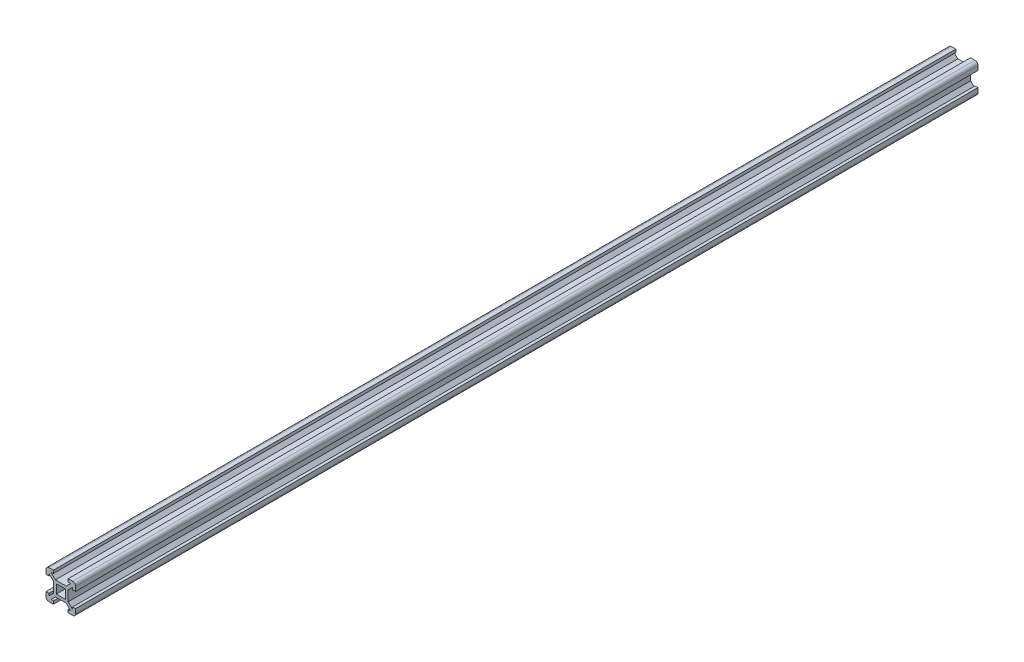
ISO-10303-21;
HEADER;
FILE_DESCRIPTION(('STEP AP214'),'2;1');
FILE_NAME('part.step','',(''),(''),'','','');
FILE_SCHEMA(('AUTOMOTIVE_DESIGN { 1 0 10303 214 1 1 1 1 }'));
ENDSEC;
DATA;
#1=APPLICATION_CONTEXT('core data for automotive mechanical design processes');
#2=APPLICATION_PROTOCOL_DEFINITION('international standard','automotive_design',2000,#1);
#3=PRODUCT_CONTEXT('',#1,'mechanical');
#4=PRODUCT('Part','Part','',(#3));
#5=PRODUCT_RELATED_PRODUCT_CATEGORY('part','',(#4));
#6=PRODUCT_DEFINITION_FORMATION('','',#4);
#7=PRODUCT_DEFINITION_CONTEXT('part definition',#1,'design');
#8=PRODUCT_DEFINITION('design','',#6,#7);
#9=PRODUCT_DEFINITION_SHAPE('','',#8);
#10=(LENGTH_UNIT() NAMED_UNIT(*) SI_UNIT(.MILLI.,.METRE.));
#11=(NAMED_UNIT(*) PLANE_ANGLE_UNIT() SI_UNIT($,.RADIAN.));
#12=(NAMED_UNIT(*) SI_UNIT($,.STERADIAN.) SOLID_ANGLE_UNIT());
#13=UNCERTAINTY_MEASURE_WITH_UNIT(LENGTH_MEASURE(1.E-05),#10,'distance_accuracy_value','');
#14=(GEOMETRIC_REPRESENTATION_CONTEXT(3) GLOBAL_UNCERTAINTY_ASSIGNED_CONTEXT((#13)) GLOBAL_UNIT_ASSIGNED_CONTEXT((#10,
#11,#12)) REPRESENTATION_CONTEXT('',''));
#15=CARTESIAN_POINT('',(0.,0.,0.));
#16=DIRECTION('',(0.,0.,1.));
#17=DIRECTION('',(1.,0.,0.));
#18=AXIS2_PLACEMENT_3D('',#15,#16,#17);
#19=CARTESIAN_POINT('',(2.00000000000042,18.0000000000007,610.));
#20=DIRECTION('',(0.,0.,-1.));
#21=DIRECTION('',(-1.,0.,0.));
#22=AXIS2_PLACEMENT_3D('',#19,#20,#21);
#23=PLANE('',#22);
#24=DIRECTION('',(0.712320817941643,-0.701854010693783,0.));
#25=VECTOR('',#24,1.);
#26=CARTESIAN_POINT('',(5.00000000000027,13.5226684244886,610.));
#27=LINE('',#26,#25);
#28=CARTESIAN_POINT('',(2.00000000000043,16.4785865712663,610.));
#29=VERTEX_POINT('',#28);
#30=CARTESIAN_POINT('',(5.00000000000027,13.5226684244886,610.));
#31=VERTEX_POINT('',#30);
#32=EDGE_CURVE('E348',#29,#31,#27,.T.);
#33=ORIENTED_EDGE('',*,*,#32,.T.);
#34=DIRECTION('',(0.,-1.,0.));
#35=VECTOR('',#34,1.);
#36=CARTESIAN_POINT('',(5.00000000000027,13.5226684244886,610.));
#37=LINE('',#36,#35);
#38=CARTESIAN_POINT('',(5.00000000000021,6.47733157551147,610.));
#39=VERTEX_POINT('',#38);
#40=EDGE_CURVE('E351',#31,#39,#37,.T.);
#41=ORIENTED_EDGE('',*,*,#40,.T.);
#42=DIRECTION('',(-0.712320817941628,-0.701854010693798,0.));
#43=VECTOR('',#42,1.);
#44=CARTESIAN_POINT('',(5.00000000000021,6.47733157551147,610.));
#45=LINE('',#44,#43);
#46=CARTESIAN_POINT('',(2.00000000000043,3.52141342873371,610.));
#47=VERTEX_POINT('',#46);
#48=EDGE_CURVE('E354',#39,#47,#45,.T.);
#49=ORIENTED_EDGE('',*,*,#48,.T.);
#50=DIRECTION('',(0.,1.,0.));
#51=VECTOR('',#50,1.);
#52=CARTESIAN_POINT('',(2.00000000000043,3.52141342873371,610.));
#53=LINE('',#52,#51);
#54=CARTESIAN_POINT('',(2.00000000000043,4.99999999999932,610.));
#55=VERTEX_POINT('',#54);
#56=EDGE_CURVE('E356',#47,#55,#53,.T.);
#57=ORIENTED_EDGE('',*,*,#56,.T.);
#58=DIRECTION('',(-1.,0.,0.));
#59=VECTOR('',#58,1.);
#60=CARTESIAN_POINT('',(4.24509251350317E-13,4.99999999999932,610.));
#61=LINE('',#60,#59);
#62=CARTESIAN_POINT('',(4.24509251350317E-13,4.99999999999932,610.));
#63=VERTEX_POINT('',#62);
#64=EDGE_CURVE('E358',#55,#63,#61,.T.);
#65=ORIENTED_EDGE('',*,*,#64,.T.);
#66=DIRECTION('',(0.,-1.,0.));
#67=VECTOR('',#66,1.);
#68=CARTESIAN_POINT('',(4.24509251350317E-13,4.99999999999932,610.));
#69=LINE('',#68,#67);
#70=CARTESIAN_POINT('',(4.24509251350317E-13,1.99999999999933,610.));
#71=VERTEX_POINT('',#70);
#72=EDGE_CURVE('E360',#63,#71,#69,.T.);
#73=ORIENTED_EDGE('',*,*,#72,.T.);
#74=CARTESIAN_POINT('',(2.00000000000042,1.99999999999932,610.));
#75=DIRECTION('',(0.,0.,1.));
#76=DIRECTION('',(1.,0.,0.));
#77=AXIS2_PLACEMENT_3D('',#74,#75,#76);
#78=CIRCLE('',#77,2.);
#79=CARTESIAN_POINT('',(2.00000000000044,-6.83481049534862E-13,610.));
#80=VERTEX_POINT('',#79);
#81=EDGE_CURVE('E362',#71,#80,#78,.T.);
#82=ORIENTED_EDGE('',*,*,#81,.T.);
#83=DIRECTION('',(1.,0.,0.));
#84=VECTOR('',#83,1.);
#85=CARTESIAN_POINT('',(2.00000000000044,-6.83481049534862E-13,610.));
#86=LINE('',#85,#84);
#87=CARTESIAN_POINT('',(5.,-6.83481049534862E-13,610.));
#88=VERTEX_POINT('',#87);
#89=EDGE_CURVE('E364',#80,#88,#86,.T.);
#90=ORIENTED_EDGE('',*,*,#89,.T.);
#91=DIRECTION('',(0.,1.,0.));
#92=VECTOR('',#91,1.);
#93=CARTESIAN_POINT('',(5.,-6.83481049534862E-13,610.));
#94=LINE('',#93,#92);
#95=CARTESIAN_POINT('',(5.,2.,610.));
#96=VERTEX_POINT('',#95);
#97=EDGE_CURVE('E366',#88,#96,#94,.T.);
#98=ORIENTED_EDGE('',*,*,#97,.T.);
#99=DIRECTION('',(-1.,0.,0.));
#100=VECTOR('',#99,1.);
#101=CARTESIAN_POINT('',(3.30549306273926,1.99999999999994,610.));
#102=LINE('',#101,#100);
#103=CARTESIAN_POINT('',(3.30549306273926,1.99999999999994,610.));
#104=VERTEX_POINT('',#103);
#105=EDGE_CURVE('E368',#96,#104,#102,.T.);
#106=ORIENTED_EDGE('',*,*,#105,.T.);
#107=DIRECTION('',(0.712320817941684,0.701854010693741,0.));
#108=VECTOR('',#107,1.);
#109=CARTESIAN_POINT('',(6.35023231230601,4.99999999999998,610.));
#110=LINE('',#109,#108);
#111=CARTESIAN_POINT('',(6.35023231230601,4.99999999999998,610.));
#112=VERTEX_POINT('',#111);
#113=EDGE_CURVE('E370',#104,#112,#110,.T.);
#114=ORIENTED_EDGE('',*,*,#113,.T.);
#115=DIRECTION('',(1.,0.,0.));
#116=VECTOR('',#115,1.);
#117=CARTESIAN_POINT('',(6.35023231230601,4.99999999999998,610.));
#118=LINE('',#117,#116);
#119=CARTESIAN_POINT('',(13.649767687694,4.99999999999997,610.));
#120=VERTEX_POINT('',#119);
#121=EDGE_CURVE('E372',#112,#120,#118,.T.);
#122=ORIENTED_EDGE('',*,*,#121,.T.);
#123=DIRECTION('',(0.712320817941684,-0.701854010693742,0.));
#124=VECTOR('',#123,1.);
#125=CARTESIAN_POINT('',(13.649767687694,4.99999999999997,610.));
#126=LINE('',#125,#124);
#127=CARTESIAN_POINT('',(16.6945069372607,1.99999999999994,610.));
#128=VERTEX_POINT('',#127);
#129=EDGE_CURVE('E374',#120,#128,#126,.T.);
#130=ORIENTED_EDGE('',*,*,#129,.T.);
#131=DIRECTION('',(-1.,0.,0.));
#132=VECTOR('',#131,1.);
#133=CARTESIAN_POINT('',(16.6945069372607,1.99999999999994,610.));
#134=LINE('',#133,#132);
#135=CARTESIAN_POINT('',(15.,2.,610.));
#136=VERTEX_POINT('',#135);
#137=EDGE_CURVE('E376',#128,#136,#134,.T.);
#138=ORIENTED_EDGE('',*,*,#137,.T.);
#139=DIRECTION('',(0.,-1.,0.));
#140=VECTOR('',#139,1.);
#141=CARTESIAN_POINT('',(15.,-6.83481049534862E-13,610.));
#142=LINE('',#141,#140);
#143=CARTESIAN_POINT('',(15.,-6.83481049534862E-13,610.));
#144=VERTEX_POINT('',#143);
#145=EDGE_CURVE('E378',#136,#144,#142,.T.);
#146=ORIENTED_EDGE('',*,*,#145,.T.);
#147=DIRECTION('',(1.,0.,0.));
#148=VECTOR('',#147,1.);
#149=CARTESIAN_POINT('',(17.9999999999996,-6.85562717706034E-13,610.));
#150=LINE('',#149,#148);
#151=CARTESIAN_POINT('',(17.9999999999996,-6.85562717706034E-13,610.));
#152=VERTEX_POINT('',#151);
#153=EDGE_CURVE('E380',#144,#152,#150,.T.);
#154=ORIENTED_EDGE('',*,*,#153,.T.);
#155=CARTESIAN_POINT('',(17.9999999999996,1.99999999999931,610.));
#156=DIRECTION('',(0.,0.,1.));
#157=DIRECTION('',(1.,0.,0.));
#158=AXIS2_PLACEMENT_3D('',#155,#156,#157);
#159=CIRCLE('',#158,2.);
#160=CARTESIAN_POINT('',(19.9999999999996,1.99999999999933,610.));
#161=VERTEX_POINT('',#160);
#162=EDGE_CURVE('E382',#152,#161,#159,.T.);
#163=ORIENTED_EDGE('',*,*,#162,.T.);
#164=DIRECTION('',(0.,1.,0.));
#165=VECTOR('',#164,1.);
#166=CARTESIAN_POINT('',(19.9999999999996,4.99999999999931,610.));
#167=LINE('',#166,#165);
#168=CARTESIAN_POINT('',(19.9999999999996,4.99999999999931,610.));
#169=VERTEX_POINT('',#168);
#170=EDGE_CURVE('E384',#161,#169,#167,.T.);
#171=ORIENTED_EDGE('',*,*,#170,.T.);
#172=DIRECTION('',(-1.,0.,0.));
#173=VECTOR('',#172,1.);
#174=CARTESIAN_POINT('',(19.9999999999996,4.99999999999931,610.));
#175=LINE('',#174,#173);
#176=CARTESIAN_POINT('',(17.9999999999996,4.99999999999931,610.));
#177=VERTEX_POINT('',#176);
#178=EDGE_CURVE('E386',#169,#177,#175,.T.);
#179=ORIENTED_EDGE('',*,*,#178,.T.);
#180=DIRECTION('',(0.,-1.,0.));
#181=VECTOR('',#180,1.);
#182=CARTESIAN_POINT('',(17.9999999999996,3.52141342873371,610.));
#183=LINE('',#182,#181);
#184=CARTESIAN_POINT('',(17.9999999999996,3.52141342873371,610.));
#185=VERTEX_POINT('',#184);
#186=EDGE_CURVE('E388',#177,#185,#183,.T.);
#187=ORIENTED_EDGE('',*,*,#186,.T.);
#188=DIRECTION('',(-0.712320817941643,0.701854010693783,0.));
#189=VECTOR('',#188,1.);
#190=CARTESIAN_POINT('',(14.9999999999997,6.47733157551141,610.));
#191=LINE('',#190,#189);
#192=CARTESIAN_POINT('',(14.9999999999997,6.47733157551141,610.));
#193=VERTEX_POINT('',#192);
#194=EDGE_CURVE('E390',#185,#193,#191,.T.);
#195=ORIENTED_EDGE('',*,*,#194,.T.);
#196=DIRECTION('',(0.,1.,0.));
#197=VECTOR('',#196,1.);
#198=CARTESIAN_POINT('',(14.9999999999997,13.5226684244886,610.));
#199=LINE('',#198,#197);
#200=CARTESIAN_POINT('',(14.9999999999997,13.5226684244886,610.));
#201=VERTEX_POINT('',#200);
#202=EDGE_CURVE('E392',#193,#201,#199,.T.);
#203=ORIENTED_EDGE('',*,*,#202,.T.);
#204=DIRECTION('',(0.712320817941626,0.7018540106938,0.));
#205=VECTOR('',#204,1.);
#206=CARTESIAN_POINT('',(14.9999999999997,13.5226684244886,610.));
#207=LINE('',#206,#205);
#208=CARTESIAN_POINT('',(17.9999999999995,16.4785865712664,610.));
#209=VERTEX_POINT('',#208);
#210=EDGE_CURVE('E394',#201,#209,#207,.T.);
#211=ORIENTED_EDGE('',*,*,#210,.T.);
#212=DIRECTION('',(0.,-1.,0.));
#213=VECTOR('',#212,1.);
#214=CARTESIAN_POINT('',(17.9999999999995,16.4785865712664,610.));
#215=LINE('',#214,#213);
#216=CARTESIAN_POINT('',(17.9999999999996,15.0000000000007,610.));
#217=VERTEX_POINT('',#216);
#218=EDGE_CURVE('E396',#209,#217,#215,.T.);
#219=ORIENTED_EDGE('',*,*,#218,.T.);
#220=DIRECTION('',(1.,0.,0.));
#221=VECTOR('',#220,1.);
#222=CARTESIAN_POINT('',(19.9999999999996,15.0000000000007,610.));
#223=LINE('',#222,#221);
#224=CARTESIAN_POINT('',(19.9999999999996,15.0000000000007,610.));
#225=VERTEX_POINT('',#224);
#226=EDGE_CURVE('E398',#217,#225,#223,.T.);
#227=ORIENTED_EDGE('',*,*,#226,.T.);
#228=DIRECTION('',(0.,1.,0.));
#229=VECTOR('',#228,1.);
#230=CARTESIAN_POINT('',(19.9999999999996,15.0000000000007,610.));
#231=LINE('',#230,#229);
#232=CARTESIAN_POINT('',(19.9999999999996,18.0000000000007,610.));
#233=VERTEX_POINT('',#232);
#234=EDGE_CURVE('E400',#225,#233,#231,.T.);
#235=ORIENTED_EDGE('',*,*,#234,.T.);
#236=CARTESIAN_POINT('',(17.9999999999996,18.0000000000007,610.));
#237=DIRECTION('',(0.,0.,1.));
#238=DIRECTION('',(1.,0.,0.));
#239=AXIS2_PLACEMENT_3D('',#236,#237,#238);
#240=CIRCLE('',#239,2.);
#241=CARTESIAN_POINT('',(17.9999999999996,20.0000000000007,610.));
#242=VERTEX_POINT('',#241);
#243=EDGE_CURVE('E402',#233,#242,#240,.T.);
#244=ORIENTED_EDGE('',*,*,#243,.T.);
#245=DIRECTION('',(-1.,0.,0.));
#246=VECTOR('',#245,1.);
#247=CARTESIAN_POINT('',(17.9999999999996,20.0000000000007,610.));
#248=LINE('',#247,#246);
#249=CARTESIAN_POINT('',(15.,20.0000000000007,610.));
#250=VERTEX_POINT('',#249);
#251=EDGE_CURVE('E404',#242,#250,#248,.T.);
#252=ORIENTED_EDGE('',*,*,#251,.T.);
#253=DIRECTION('',(0.,-1.,0.));
#254=VECTOR('',#253,1.);
#255=CARTESIAN_POINT('',(15.,20.0000000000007,610.));
#256=LINE('',#255,#254);
#257=CARTESIAN_POINT('',(15.,18.,610.));
#258=VERTEX_POINT('',#257);
#259=EDGE_CURVE('E406',#250,#258,#256,.T.);
#260=ORIENTED_EDGE('',*,*,#259,.T.);
#261=DIRECTION('',(1.,0.,0.));
#262=VECTOR('',#261,1.);
#263=CARTESIAN_POINT('',(16.6945069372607,18.0000000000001,610.));
#264=LINE('',#263,#262);
#265=CARTESIAN_POINT('',(16.6945069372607,18.0000000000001,610.));
#266=VERTEX_POINT('',#265);
#267=EDGE_CURVE('E408',#258,#266,#264,.T.);
#268=ORIENTED_EDGE('',*,*,#267,.T.);
#269=DIRECTION('',(-0.712320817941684,-0.701854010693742,0.));
#270=VECTOR('',#269,1.);
#271=CARTESIAN_POINT('',(13.649767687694,15.,610.));
#272=LINE('',#271,#270);
#273=CARTESIAN_POINT('',(13.649767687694,15.,610.));
#274=VERTEX_POINT('',#273);
#275=EDGE_CURVE('E410',#266,#274,#272,.T.);
#276=ORIENTED_EDGE('',*,*,#275,.T.);
#277=DIRECTION('',(-1.,0.,0.));
#278=VECTOR('',#277,1.);
#279=CARTESIAN_POINT('',(6.35023231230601,15.,610.));
#280=LINE('',#279,#278);
#281=CARTESIAN_POINT('',(6.35023231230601,15.,610.));
#282=VERTEX_POINT('',#281);
#283=EDGE_CURVE('E412',#274,#282,#280,.T.);
#284=ORIENTED_EDGE('',*,*,#283,.T.);
#285=DIRECTION('',(-0.712320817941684,0.701854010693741,0.));
#286=VECTOR('',#285,1.);
#287=CARTESIAN_POINT('',(6.35023231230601,15.,610.));
#288=LINE('',#287,#286);
#289=CARTESIAN_POINT('',(3.30549306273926,18.0000000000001,610.));
#290=VERTEX_POINT('',#289);
#291=EDGE_CURVE('E414',#282,#290,#288,.T.);
#292=ORIENTED_EDGE('',*,*,#291,.T.);
#293=DIRECTION('',(1.,0.,0.));
#294=VECTOR('',#293,1.);
#295=CARTESIAN_POINT('',(3.30549306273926,18.0000000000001,610.));
#296=LINE('',#295,#294);
#297=CARTESIAN_POINT('',(5.,18.,610.));
#298=VERTEX_POINT('',#297);
#299=EDGE_CURVE('E416',#290,#298,#296,.T.);
#300=ORIENTED_EDGE('',*,*,#299,.T.);
#301=DIRECTION('',(0.,1.,0.));
#302=VECTOR('',#301,1.);
#303=CARTESIAN_POINT('',(5.,20.0000000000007,610.));
#304=LINE('',#303,#302);
#305=CARTESIAN_POINT('',(5.,20.0000000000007,610.));
#306=VERTEX_POINT('',#305);
#307=EDGE_CURVE('E418',#298,#306,#304,.T.);
#308=ORIENTED_EDGE('',*,*,#307,.T.);
#309=DIRECTION('',(-1.,0.,0.));
#310=VECTOR('',#309,1.);
#311=CARTESIAN_POINT('',(2.00000000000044,20.0000000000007,610.));
#312=LINE('',#311,#310);
#313=CARTESIAN_POINT('',(2.00000000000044,20.0000000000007,610.));
#314=VERTEX_POINT('',#313);
#315=EDGE_CURVE('E420',#306,#314,#312,.T.);
#316=ORIENTED_EDGE('',*,*,#315,.T.);
#317=CARTESIAN_POINT('',(2.00000000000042,18.0000000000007,610.));
#318=DIRECTION('',(0.,0.,1.));
#319=DIRECTION('',(-1.,0.,0.));
#320=AXIS2_PLACEMENT_3D('',#317,#318,#319);
#321=CIRCLE('',#320,2.);
#322=CARTESIAN_POINT('',(4.25007251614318E-13,18.0000000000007,610.));
#323=VERTEX_POINT('',#322);
#324=EDGE_CURVE('E422',#314,#323,#321,.T.);
#325=ORIENTED_EDGE('',*,*,#324,.T.);
#326=DIRECTION('',(0.,-1.,0.));
#327=VECTOR('',#326,1.);
#328=CARTESIAN_POINT('',(4.24509251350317E-13,15.0000000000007,610.));
#329=LINE('',#328,#327);
#330=CARTESIAN_POINT('',(4.24509251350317E-13,15.0000000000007,610.));
#331=VERTEX_POINT('',#330);
#332=EDGE_CURVE('E424',#323,#331,#329,.T.);
#333=ORIENTED_EDGE('',*,*,#332,.T.);
#334=DIRECTION('',(1.,0.,0.));
#335=VECTOR('',#334,1.);
#336=CARTESIAN_POINT('',(4.24509251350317E-13,15.0000000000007,610.));
#337=LINE('',#336,#335);
#338=CARTESIAN_POINT('',(2.00000000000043,15.0000000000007,610.));
#339=VERTEX_POINT('',#338);
#340=EDGE_CURVE('E426',#331,#339,#337,.T.);
#341=ORIENTED_EDGE('',*,*,#340,.T.);
#342=DIRECTION('',(0.,1.,0.));
#343=VECTOR('',#342,1.);
#344=CARTESIAN_POINT('',(2.00000000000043,16.4785865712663,610.));
#345=LINE('',#344,#343);
#346=EDGE_CURVE('E428',#339,#29,#345,.T.);
#347=ORIENTED_EDGE('',*,*,#346,.T.);
#348=EDGE_LOOP('',(#33,#41,#49,#57,#65,#73,#82,#90,#98,#106,#114,#122,#130,#138,#146,#154,#163,
#171,#179,#187,#195,#203,#211,#219,#227,#235,#244,#252,#260,#268,#276,#284,#292,#300,#308,#316,
#325,#333,#341,#347));
#349=FACE_BOUND('',#348,.T.);
#350=DIRECTION('',(0.,1.,0.));
#351=VECTOR('',#350,1.);
#352=CARTESIAN_POINT('',(13.0427076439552,13.0427076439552,610.));
#353=LINE('',#352,#351);
#354=CARTESIAN_POINT('',(13.0427076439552,6.9572923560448,610.));
#355=VERTEX_POINT('',#354);
#356=CARTESIAN_POINT('',(13.0427076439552,13.0427076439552,610.));
#357=VERTEX_POINT('',#356);
#358=EDGE_CURVE('E312',#355,#357,#353,.T.);
#359=ORIENTED_EDGE('',*,*,#358,.F.);
#360=DIRECTION('',(1.,0.,0.));
#361=VECTOR('',#360,1.);
#362=CARTESIAN_POINT('',(6.95729235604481,6.9572923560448,610.));
#363=LINE('',#362,#361);
#364=CARTESIAN_POINT('',(6.95729235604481,6.9572923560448,610.));
#365=VERTEX_POINT('',#364);
#366=EDGE_CURVE('E334',#365,#355,#363,.T.);
#367=ORIENTED_EDGE('',*,*,#366,.F.);
#368=DIRECTION('',(0.,-1.,0.));
#369=VECTOR('',#368,1.);
#370=CARTESIAN_POINT('',(6.95729235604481,13.0427076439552,610.));
#371=LINE('',#370,#369);
#372=CARTESIAN_POINT('',(6.95729235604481,13.0427076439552,610.));
#373=VERTEX_POINT('',#372);
#374=EDGE_CURVE('E332',#373,#365,#371,.T.);
#375=ORIENTED_EDGE('',*,*,#374,.F.);
#376=DIRECTION('',(-1.,0.,0.));
#377=VECTOR('',#376,1.);
#378=CARTESIAN_POINT('',(6.95729235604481,13.0427076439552,610.));
#379=LINE('',#378,#377);
#380=EDGE_CURVE('E320',#357,#373,#379,.T.);
#381=ORIENTED_EDGE('',*,*,#380,.F.);
#382=EDGE_LOOP('',(#359,#367,#375,#381));
#383=FACE_BOUND('',#382,.T.);
#384=ADVANCED_FACE('F31',(#349,#383),#23,.F.);
#385=CARTESIAN_POINT('',(2.00000000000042,18.0000000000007,0.));
#386=DIRECTION('',(0.,0.,-1.));
#387=DIRECTION('',(-1.,0.,0.));
#388=AXIS2_PLACEMENT_3D('',#385,#386,#387);
#389=PLANE('',#388);
#390=DIRECTION('',(0.712320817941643,-0.701854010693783,0.));
#391=VECTOR('',#390,1.);
#392=CARTESIAN_POINT('',(5.00000000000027,13.5226684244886,0.));
#393=LINE('',#392,#391);
#394=CARTESIAN_POINT('',(2.00000000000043,16.4785865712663,0.));
#395=VERTEX_POINT('',#394);
#396=CARTESIAN_POINT('',(5.00000000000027,13.5226684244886,0.));
#397=VERTEX_POINT('',#396);
#398=EDGE_CURVE('E328',#395,#397,#393,.T.);
#399=ORIENTED_EDGE('',*,*,#398,.F.);
#400=DIRECTION('',(0.,1.,0.));
#401=VECTOR('',#400,1.);
#402=CARTESIAN_POINT('',(2.00000000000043,16.4785865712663,0.));
#403=LINE('',#402,#401);
#404=CARTESIAN_POINT('',(2.00000000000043,15.0000000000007,0.));
#405=VERTEX_POINT('',#404);
#406=EDGE_CURVE('E352',#405,#395,#403,.T.);
#407=ORIENTED_EDGE('',*,*,#406,.F.);
#408=DIRECTION('',(1.,0.,0.));
#409=VECTOR('',#408,1.);
#410=CARTESIAN_POINT('',(4.24509251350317E-13,15.0000000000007,0.));
#411=LINE('',#410,#409);
#412=CARTESIAN_POINT('',(4.24509251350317E-13,15.0000000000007,0.));
#413=VERTEX_POINT('',#412);
#414=EDGE_CURVE('E507',#413,#405,#411,.T.);
#415=ORIENTED_EDGE('',*,*,#414,.F.);
#416=DIRECTION('',(0.,-1.,0.));
#417=VECTOR('',#416,1.);
#418=CARTESIAN_POINT('',(4.24509251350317E-13,15.0000000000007,0.));
#419=LINE('',#418,#417);
#420=CARTESIAN_POINT('',(4.25007251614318E-13,18.0000000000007,0.));
#421=VERTEX_POINT('',#420);
#422=EDGE_CURVE('E505',#421,#413,#419,.T.);
#423=ORIENTED_EDGE('',*,*,#422,.F.);
#424=CARTESIAN_POINT('',(2.00000000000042,18.0000000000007,0.));
#425=DIRECTION('',(0.,0.,1.));
#426=DIRECTION('',(-1.,0.,0.));
#427=AXIS2_PLACEMENT_3D('',#424,#425,#426);
#428=CIRCLE('',#427,2.);
#429=CARTESIAN_POINT('',(2.00000000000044,20.0000000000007,0.));
#430=VERTEX_POINT('',#429);
#431=EDGE_CURVE('E503',#430,#421,#428,.T.);
#432=ORIENTED_EDGE('',*,*,#431,.F.);
#433=DIRECTION('',(-1.,0.,0.));
#434=VECTOR('',#433,1.);
#435=CARTESIAN_POINT('',(2.00000000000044,20.0000000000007,0.));
#436=LINE('',#435,#434);
#437=CARTESIAN_POINT('',(5.,20.0000000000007,0.));
#438=VERTEX_POINT('',#437);
#439=EDGE_CURVE('E501',#438,#430,#436,.T.);
#440=ORIENTED_EDGE('',*,*,#439,.F.);
#441=DIRECTION('',(0.,1.,0.));
#442=VECTOR('',#441,1.);
#443=CARTESIAN_POINT('',(5.,20.0000000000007,0.));
#444=LINE('',#443,#442);
#445=CARTESIAN_POINT('',(5.,18.,0.));
#446=VERTEX_POINT('',#445);
#447=EDGE_CURVE('E499',#446,#438,#444,.T.);
#448=ORIENTED_EDGE('',*,*,#447,.F.);
#449=DIRECTION('',(1.,0.,0.));
#450=VECTOR('',#449,1.);
#451=CARTESIAN_POINT('',(3.30549306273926,18.0000000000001,0.));
#452=LINE('',#451,#450);
#453=CARTESIAN_POINT('',(3.30549306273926,18.0000000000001,0.));
#454=VERTEX_POINT('',#453);
#455=EDGE_CURVE('E497',#454,#446,#452,.T.);
#456=ORIENTED_EDGE('',*,*,#455,.F.);
#457=DIRECTION('',(-0.712320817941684,0.701854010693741,0.));
#458=VECTOR('',#457,1.);
#459=CARTESIAN_POINT('',(6.35023231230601,15.,0.));
#460=LINE('',#459,#458);
#461=CARTESIAN_POINT('',(6.35023231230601,15.,0.));
#462=VERTEX_POINT('',#461);
#463=EDGE_CURVE('E495',#462,#454,#460,.T.);
#464=ORIENTED_EDGE('',*,*,#463,.F.);
#465=DIRECTION('',(-1.,0.,0.));
#466=VECTOR('',#465,1.);
#467=CARTESIAN_POINT('',(6.35023231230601,15.,0.));
#468=LINE('',#467,#466);
#469=CARTESIAN_POINT('',(13.649767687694,15.,0.));
#470=VERTEX_POINT('',#469);
#471=EDGE_CURVE('E493',#470,#462,#468,.T.);
#472=ORIENTED_EDGE('',*,*,#471,.F.);
#473=DIRECTION('',(-0.712320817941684,-0.701854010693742,0.));
#474=VECTOR('',#473,1.);
#475=CARTESIAN_POINT('',(13.649767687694,15.,0.));
#476=LINE('',#475,#474);
#477=CARTESIAN_POINT('',(16.6945069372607,18.0000000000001,0.));
#478=VERTEX_POINT('',#477);
#479=EDGE_CURVE('E491',#478,#470,#476,.T.);
#480=ORIENTED_EDGE('',*,*,#479,.F.);
#481=DIRECTION('',(1.,0.,0.));
#482=VECTOR('',#481,1.);
#483=CARTESIAN_POINT('',(16.6945069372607,18.0000000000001,0.));
#484=LINE('',#483,#482);
#485=CARTESIAN_POINT('',(15.,18.,0.));
#486=VERTEX_POINT('',#485);
#487=EDGE_CURVE('E489',#486,#478,#484,.T.);
#488=ORIENTED_EDGE('',*,*,#487,.F.);
#489=DIRECTION('',(0.,-1.,0.));
#490=VECTOR('',#489,1.);
#491=CARTESIAN_POINT('',(15.,20.0000000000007,0.));
#492=LINE('',#491,#490);
#493=CARTESIAN_POINT('',(15.,20.0000000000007,0.));
#494=VERTEX_POINT('',#493);
#495=EDGE_CURVE('E487',#494,#486,#492,.T.);
#496=ORIENTED_EDGE('',*,*,#495,.F.);
#497=DIRECTION('',(-1.,0.,0.));
#498=VECTOR('',#497,1.);
#499=CARTESIAN_POINT('',(17.9999999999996,20.0000000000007,0.));
#500=LINE('',#499,#498);
#501=CARTESIAN_POINT('',(17.9999999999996,20.0000000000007,0.));
#502=VERTEX_POINT('',#501);
#503=EDGE_CURVE('E485',#502,#494,#500,.T.);
#504=ORIENTED_EDGE('',*,*,#503,.F.);
#505=CARTESIAN_POINT('',(17.9999999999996,18.0000000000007,0.));
#506=DIRECTION('',(0.,0.,1.));
#507=DIRECTION('',(1.,0.,0.));
#508=AXIS2_PLACEMENT_3D('',#505,#506,#507);
#509=CIRCLE('',#508,2.);
#510=CARTESIAN_POINT('',(19.9999999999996,18.0000000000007,0.));
#511=VERTEX_POINT('',#510);
#512=EDGE_CURVE('E483',#511,#502,#509,.T.);
#513=ORIENTED_EDGE('',*,*,#512,.F.);
#514=DIRECTION('',(0.,1.,0.));
#515=VECTOR('',#514,1.);
#516=CARTESIAN_POINT('',(19.9999999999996,15.0000000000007,0.));
#517=LINE('',#516,#515);
#518=CARTESIAN_POINT('',(19.9999999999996,15.0000000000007,0.));
#519=VERTEX_POINT('',#518);
#520=EDGE_CURVE('E481',#519,#511,#517,.T.);
#521=ORIENTED_EDGE('',*,*,#520,.F.);
#522=DIRECTION('',(1.,0.,0.));
#523=VECTOR('',#522,1.);
#524=CARTESIAN_POINT('',(19.9999999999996,15.0000000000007,0.));
#525=LINE('',#524,#523);
#526=CARTESIAN_POINT('',(17.9999999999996,15.0000000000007,0.));
#527=VERTEX_POINT('',#526);
#528=EDGE_CURVE('E479',#527,#519,#525,.T.);
#529=ORIENTED_EDGE('',*,*,#528,.F.);
#530=DIRECTION('',(0.,-1.,0.));
#531=VECTOR('',#530,1.);
#532=CARTESIAN_POINT('',(17.9999999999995,16.4785865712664,0.));
#533=LINE('',#532,#531);
#534=CARTESIAN_POINT('',(17.9999999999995,16.4785865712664,0.));
#535=VERTEX_POINT('',#534);
#536=EDGE_CURVE('E477',#535,#527,#533,.T.);
#537=ORIENTED_EDGE('',*,*,#536,.F.);
#538=DIRECTION('',(0.712320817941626,0.7018540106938,0.));
#539=VECTOR('',#538,1.);
#540=CARTESIAN_POINT('',(14.9999999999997,13.5226684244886,0.));
#541=LINE('',#540,#539);
#542=CARTESIAN_POINT('',(14.9999999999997,13.5226684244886,0.));
#543=VERTEX_POINT('',#542);
#544=EDGE_CURVE('E475',#543,#535,#541,.T.);
#545=ORIENTED_EDGE('',*,*,#544,.F.);
#546=DIRECTION('',(0.,1.,0.));
#547=VECTOR('',#546,1.);
#548=CARTESIAN_POINT('',(14.9999999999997,13.5226684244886,0.));
#549=LINE('',#548,#547);
#550=CARTESIAN_POINT('',(14.9999999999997,6.47733157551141,0.));
#551=VERTEX_POINT('',#550);
#552=EDGE_CURVE('E473',#551,#543,#549,.T.);
#553=ORIENTED_EDGE('',*,*,#552,.F.);
#554=DIRECTION('',(-0.712320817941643,0.701854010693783,0.));
#555=VECTOR('',#554,1.);
#556=CARTESIAN_POINT('',(14.9999999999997,6.47733157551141,0.));
#557=LINE('',#556,#555);
#558=CARTESIAN_POINT('',(17.9999999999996,3.52141342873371,0.));
#559=VERTEX_POINT('',#558);
#560=EDGE_CURVE('E471',#559,#551,#557,.T.);
#561=ORIENTED_EDGE('',*,*,#560,.F.);
#562=DIRECTION('',(0.,-1.,0.));
#563=VECTOR('',#562,1.);
#564=CARTESIAN_POINT('',(17.9999999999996,3.52141342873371,0.));
#565=LINE('',#564,#563);
#566=CARTESIAN_POINT('',(17.9999999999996,4.99999999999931,0.));
#567=VERTEX_POINT('',#566);
#568=EDGE_CURVE('E469',#567,#559,#565,.T.);
#569=ORIENTED_EDGE('',*,*,#568,.F.);
#570=DIRECTION('',(-1.,0.,0.));
#571=VECTOR('',#570,1.);
#572=CARTESIAN_POINT('',(19.9999999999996,4.99999999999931,0.));
#573=LINE('',#572,#571);
#574=CARTESIAN_POINT('',(19.9999999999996,4.99999999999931,0.));
#575=VERTEX_POINT('',#574);
#576=EDGE_CURVE('E467',#575,#567,#573,.T.);
#577=ORIENTED_EDGE('',*,*,#576,.F.);
#578=DIRECTION('',(0.,1.,0.));
#579=VECTOR('',#578,1.);
#580=CARTESIAN_POINT('',(19.9999999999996,4.99999999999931,0.));
#581=LINE('',#580,#579);
#582=CARTESIAN_POINT('',(19.9999999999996,1.99999999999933,0.));
#583=VERTEX_POINT('',#582);
#584=EDGE_CURVE('E465',#583,#575,#581,.T.);
#585=ORIENTED_EDGE('',*,*,#584,.F.);
#586=CARTESIAN_POINT('',(17.9999999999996,1.99999999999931,0.));
#587=DIRECTION('',(0.,0.,1.));
#588=DIRECTION('',(1.,0.,0.));
#589=AXIS2_PLACEMENT_3D('',#586,#587,#588);
#590=CIRCLE('',#589,2.);
#591=CARTESIAN_POINT('',(17.9999999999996,-6.85562717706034E-13,0.));
#592=VERTEX_POINT('',#591);
#593=EDGE_CURVE('E463',#592,#583,#590,.T.);
#594=ORIENTED_EDGE('',*,*,#593,.F.);
#595=DIRECTION('',(1.,0.,0.));
#596=VECTOR('',#595,1.);
#597=CARTESIAN_POINT('',(17.9999999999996,-6.85562717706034E-13,0.));
#598=LINE('',#597,#596);
#599=CARTESIAN_POINT('',(15.,-6.83481049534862E-13,0.));
#600=VERTEX_POINT('',#599);
#601=EDGE_CURVE('E461',#600,#592,#598,.T.);
#602=ORIENTED_EDGE('',*,*,#601,.F.);
#603=DIRECTION('',(0.,-1.,0.));
#604=VECTOR('',#603,1.);
#605=CARTESIAN_POINT('',(15.,-6.83481049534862E-13,0.));
#606=LINE('',#605,#604);
#607=CARTESIAN_POINT('',(15.,2.,0.));
#608=VERTEX_POINT('',#607);
#609=EDGE_CURVE('E459',#608,#600,#606,.T.);
#610=ORIENTED_EDGE('',*,*,#609,.F.);
#611=DIRECTION('',(-1.,0.,0.));
#612=VECTOR('',#611,1.);
#613=CARTESIAN_POINT('',(16.6945069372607,1.99999999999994,0.));
#614=LINE('',#613,#612);
#615=CARTESIAN_POINT('',(16.6945069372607,1.99999999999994,0.));
#616=VERTEX_POINT('',#615);
#617=EDGE_CURVE('E457',#616,#608,#614,.T.);
#618=ORIENTED_EDGE('',*,*,#617,.F.);
#619=DIRECTION('',(0.712320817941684,-0.701854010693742,0.));
#620=VECTOR('',#619,1.);
#621=CARTESIAN_POINT('',(13.649767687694,4.99999999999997,0.));
#622=LINE('',#621,#620);
#623=CARTESIAN_POINT('',(13.649767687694,4.99999999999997,0.));
#624=VERTEX_POINT('',#623);
#625=EDGE_CURVE('E455',#624,#616,#622,.T.);
#626=ORIENTED_EDGE('',*,*,#625,.F.);
#627=DIRECTION('',(1.,0.,0.));
#628=VECTOR('',#627,1.);
#629=CARTESIAN_POINT('',(6.35023231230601,4.99999999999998,0.));
#630=LINE('',#629,#628);
#631=CARTESIAN_POINT('',(6.35023231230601,4.99999999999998,0.));
#632=VERTEX_POINT('',#631);
#633=EDGE_CURVE('E453',#632,#624,#630,.T.);
#634=ORIENTED_EDGE('',*,*,#633,.F.);
#635=DIRECTION('',(0.712320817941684,0.701854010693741,0.));
#636=VECTOR('',#635,1.);
#637=CARTESIAN_POINT('',(6.35023231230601,4.99999999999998,0.));
#638=LINE('',#637,#636);
#639=CARTESIAN_POINT('',(3.30549306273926,1.99999999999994,0.));
#640=VERTEX_POINT('',#639);
#641=EDGE_CURVE('E451',#640,#632,#638,.T.);
#642=ORIENTED_EDGE('',*,*,#641,.F.);
#643=DIRECTION('',(-1.,0.,0.));
#644=VECTOR('',#643,1.);
#645=CARTESIAN_POINT('',(3.30549306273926,1.99999999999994,0.));
#646=LINE('',#645,#644);
#647=CARTESIAN_POINT('',(5.,2.,0.));
#648=VERTEX_POINT('',#647);
#649=EDGE_CURVE('E449',#648,#640,#646,.T.);
#650=ORIENTED_EDGE('',*,*,#649,.F.);
#651=DIRECTION('',(0.,1.,0.));
#652=VECTOR('',#651,1.);
#653=CARTESIAN_POINT('',(5.,-6.83481049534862E-13,0.));
#654=LINE('',#653,#652);
#655=CARTESIAN_POINT('',(5.,-6.83481049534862E-13,0.));
#656=VERTEX_POINT('',#655);
#657=EDGE_CURVE('E447',#656,#648,#654,.T.);
#658=ORIENTED_EDGE('',*,*,#657,.F.);
#659=DIRECTION('',(1.,0.,0.));
#660=VECTOR('',#659,1.);
#661=CARTESIAN_POINT('',(2.00000000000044,-6.83481049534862E-13,0.));
#662=LINE('',#661,#660);
#663=CARTESIAN_POINT('',(2.00000000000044,-6.83481049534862E-13,0.));
#664=VERTEX_POINT('',#663);
#665=EDGE_CURVE('E445',#664,#656,#662,.T.);
#666=ORIENTED_EDGE('',*,*,#665,.F.);
#667=CARTESIAN_POINT('',(2.00000000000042,1.99999999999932,0.));
#668=DIRECTION('',(0.,0.,1.));
#669=DIRECTION('',(1.,0.,0.));
#670=AXIS2_PLACEMENT_3D('',#667,#668,#669);
#671=CIRCLE('',#670,2.);
#672=CARTESIAN_POINT('',(4.24509251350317E-13,1.99999999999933,0.));
#673=VERTEX_POINT('',#672);
#674=EDGE_CURVE('E443',#673,#664,#671,.T.);
#675=ORIENTED_EDGE('',*,*,#674,.F.);
#676=DIRECTION('',(0.,-1.,0.));
#677=VECTOR('',#676,1.);
#678=CARTESIAN_POINT('',(4.24509251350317E-13,4.99999999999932,0.));
#679=LINE('',#678,#677);
#680=CARTESIAN_POINT('',(4.24509251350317E-13,4.99999999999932,0.));
#681=VERTEX_POINT('',#680);
#682=EDGE_CURVE('E441',#681,#673,#679,.T.);
#683=ORIENTED_EDGE('',*,*,#682,.F.);
#684=DIRECTION('',(-1.,0.,0.));
#685=VECTOR('',#684,1.);
#686=CARTESIAN_POINT('',(4.24509251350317E-13,4.99999999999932,0.));
#687=LINE('',#686,#685);
#688=CARTESIAN_POINT('',(2.00000000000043,4.99999999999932,0.));
#689=VERTEX_POINT('',#688);
#690=EDGE_CURVE('E439',#689,#681,#687,.T.);
#691=ORIENTED_EDGE('',*,*,#690,.F.);
#692=DIRECTION('',(0.,1.,0.));
#693=VECTOR('',#692,1.);
#694=CARTESIAN_POINT('',(2.00000000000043,3.52141342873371,0.));
#695=LINE('',#694,#693);
#696=CARTESIAN_POINT('',(2.00000000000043,3.52141342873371,0.));
#697=VERTEX_POINT('',#696);
#698=EDGE_CURVE('E437',#697,#689,#695,.T.);
#699=ORIENTED_EDGE('',*,*,#698,.F.);
#700=DIRECTION('',(-0.712320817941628,-0.701854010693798,0.));
#701=VECTOR('',#700,1.);
#702=CARTESIAN_POINT('',(5.00000000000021,6.47733157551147,0.));
#703=LINE('',#702,#701);
#704=CARTESIAN_POINT('',(5.00000000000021,6.47733157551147,0.));
#705=VERTEX_POINT('',#704);
#706=EDGE_CURVE('E435',#705,#697,#703,.T.);
#707=ORIENTED_EDGE('',*,*,#706,.F.);
#708=DIRECTION('',(0.,-1.,0.));
#709=VECTOR('',#708,1.);
#710=CARTESIAN_POINT('',(5.00000000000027,13.5226684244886,0.));
#711=LINE('',#710,#709);
#712=EDGE_CURVE('E433',#397,#705,#711,.T.);
#713=ORIENTED_EDGE('',*,*,#712,.F.);
#714=EDGE_LOOP('',(#399,#407,#415,#423,#432,#440,#448,#456,#464,#472,#480,#488,#496,#504,#513,
#521,#529,#537,#545,#553,#561,#569,#577,#585,#594,#602,#610,#618,#626,#634,#642,#650,#658,#666,
#675,#683,#691,#699,#707,#713));
#715=FACE_BOUND('',#714,.T.);
#716=DIRECTION('',(1.,0.,0.));
#717=VECTOR('',#716,1.);
#718=CARTESIAN_POINT('',(6.95729235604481,6.9572923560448,0.));
#719=LINE('',#718,#717);
#720=CARTESIAN_POINT('',(6.95729235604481,6.9572923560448,0.));
#721=VERTEX_POINT('',#720);
#722=CARTESIAN_POINT('',(13.0427076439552,6.9572923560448,0.));
#723=VERTEX_POINT('',#722);
#724=EDGE_CURVE('E321',#721,#723,#719,.T.);
#725=ORIENTED_EDGE('',*,*,#724,.T.);
#726=DIRECTION('',(0.,1.,0.));
#727=VECTOR('',#726,1.);
#728=CARTESIAN_POINT('',(13.0427076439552,13.0427076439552,0.));
#729=LINE('',#728,#727);
#730=CARTESIAN_POINT('',(13.0427076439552,13.0427076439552,0.));
#731=VERTEX_POINT('',#730);
#732=EDGE_CURVE('E54',#723,#731,#729,.T.);
#733=ORIENTED_EDGE('',*,*,#732,.T.);
#734=DIRECTION('',(-1.,0.,0.));
#735=VECTOR('',#734,1.);
#736=CARTESIAN_POINT('',(6.95729235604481,13.0427076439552,0.));
#737=LINE('',#736,#735);
#738=CARTESIAN_POINT('',(6.95729235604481,13.0427076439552,0.));
#739=VERTEX_POINT('',#738);
#740=EDGE_CURVE('E327',#731,#739,#737,.T.);
#741=ORIENTED_EDGE('',*,*,#740,.T.);
#742=DIRECTION('',(0.,-1.,0.));
#743=VECTOR('',#742,1.);
#744=CARTESIAN_POINT('',(6.95729235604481,13.0427076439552,0.));
#745=LINE('',#744,#743);
#746=EDGE_CURVE('E340',#739,#721,#745,.T.);
#747=ORIENTED_EDGE('',*,*,#746,.T.);
#748=EDGE_LOOP('',(#725,#733,#741,#747));
#749=FACE_BOUND('',#748,.T.);
#750=ADVANCED_FACE('F633',(#715,#749),#389,.T.);
#751=CARTESIAN_POINT('',(5.00000000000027,13.5226684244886,610.));
#752=DIRECTION('',(0.701854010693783,0.712320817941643,0.));
#753=DIRECTION('',(-0.712320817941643,0.701854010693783,0.));
#754=AXIS2_PLACEMENT_3D('',#751,#752,#753);
#755=PLANE('',#754);
#756=ORIENTED_EDGE('',*,*,#398,.T.);
#757=DIRECTION('',(0.,0.,-1.));
#758=VECTOR('',#757,1.);
#759=CARTESIAN_POINT('',(5.00000000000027,13.5226684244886,610.));
#760=LINE('',#759,#758);
#761=EDGE_CURVE('E11',#31,#397,#760,.T.);
#762=ORIENTED_EDGE('',*,*,#761,.F.);
#763=ORIENTED_EDGE('',*,*,#32,.F.);
#764=DIRECTION('',(0.,0.,-1.));
#765=VECTOR('',#764,1.);
#766=CARTESIAN_POINT('',(2.00000000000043,16.4785865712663,610.));
#767=LINE('',#766,#765);
#768=EDGE_CURVE('E430',#29,#395,#767,.T.);
#769=ORIENTED_EDGE('',*,*,#768,.T.);
#770=EDGE_LOOP('',(#756,#762,#763,#769));
#771=FACE_BOUND('',#770,.T.);
#772=ADVANCED_FACE('F33',(#771),#755,.F.);
#773=CARTESIAN_POINT('',(5.00000000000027,13.5226684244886,610.));
#774=DIRECTION('',(1.,0.,0.));
#775=DIRECTION('',(0.,1.,0.));
#776=AXIS2_PLACEMENT_3D('',#773,#774,#775);
#777=PLANE('',#776);
#778=ORIENTED_EDGE('',*,*,#712,.T.);
#779=DIRECTION('',(0.,0.,-1.));
#780=VECTOR('',#779,1.);
#781=CARTESIAN_POINT('',(5.00000000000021,6.47733157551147,610.));
#782=LINE('',#781,#780);
#783=EDGE_CURVE('E39',#39,#705,#782,.T.);
#784=ORIENTED_EDGE('',*,*,#783,.F.);
#785=ORIENTED_EDGE('',*,*,#40,.F.);
#786=ORIENTED_EDGE('',*,*,#761,.T.);
#787=EDGE_LOOP('',(#778,#784,#785,#786));
#788=FACE_BOUND('',#787,.T.);
#789=ADVANCED_FACE('F650',(#788),#777,.F.);
#790=CARTESIAN_POINT('',(5.00000000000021,6.47733157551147,610.));
#791=DIRECTION('',(0.701854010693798,-0.712320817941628,0.));
#792=DIRECTION('',(0.712320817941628,0.701854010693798,0.));
#793=AXIS2_PLACEMENT_3D('',#790,#791,#792);
#794=PLANE('',#793);
#795=ORIENTED_EDGE('',*,*,#706,.T.);
#796=DIRECTION('',(0.,0.,-1.));
#797=VECTOR('',#796,1.);
#798=CARTESIAN_POINT('',(2.00000000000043,3.52141342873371,610.));
#799=LINE('',#798,#797);
#800=EDGE_CURVE('E620',#47,#697,#799,.T.);
#801=ORIENTED_EDGE('',*,*,#800,.F.);
#802=ORIENTED_EDGE('',*,*,#48,.F.);
#803=ORIENTED_EDGE('',*,*,#783,.T.);
#804=EDGE_LOOP('',(#795,#801,#802,#803));
#805=FACE_BOUND('',#804,.T.);
#806=ADVANCED_FACE('F627',(#805),#794,.F.);
#807=CARTESIAN_POINT('',(2.00000000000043,3.52141342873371,610.));
#808=DIRECTION('',(-1.,0.,0.));
#809=DIRECTION('',(0.,0.,1.));
#810=AXIS2_PLACEMENT_3D('',#807,#808,#809);
#811=PLANE('',#810);
#812=ORIENTED_EDGE('',*,*,#698,.T.);
#813=DIRECTION('',(0.,0.,-1.));
#814=VECTOR('',#813,1.);
#815=CARTESIAN_POINT('',(2.00000000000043,4.99999999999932,610.));
#816=LINE('',#815,#814);
#817=EDGE_CURVE('E617',#55,#689,#816,.T.);
#818=ORIENTED_EDGE('',*,*,#817,.F.);
#819=ORIENTED_EDGE('',*,*,#56,.F.);
#820=ORIENTED_EDGE('',*,*,#800,.T.);
#821=EDGE_LOOP('',(#812,#818,#819,#820));
#822=FACE_BOUND('',#821,.T.);
#823=ADVANCED_FACE('F639',(#822),#811,.F.);
#824=CARTESIAN_POINT('',(4.24509251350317E-13,4.99999999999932,610.));
#825=DIRECTION('',(0.,-1.,0.));
#826=DIRECTION('',(0.,0.,-1.));
#827=AXIS2_PLACEMENT_3D('',#824,#825,#826);
#828=PLANE('',#827);
#829=ORIENTED_EDGE('',*,*,#690,.T.);
#830=DIRECTION('',(0.,0.,-1.));
#831=VECTOR('',#830,1.);
#832=CARTESIAN_POINT('',(4.24509251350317E-13,4.99999999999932,610.));
#833=LINE('',#832,#831);
#834=EDGE_CURVE('E614',#63,#681,#833,.T.);
#835=ORIENTED_EDGE('',*,*,#834,.F.);
#836=ORIENTED_EDGE('',*,*,#64,.F.);
#837=ORIENTED_EDGE('',*,*,#817,.T.);
#838=EDGE_LOOP('',(#829,#835,#836,#837));
#839=FACE_BOUND('',#838,.T.);
#840=ADVANCED_FACE('F643',(#839),#828,.F.);
#841=CARTESIAN_POINT('',(4.24509251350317E-13,4.99999999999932,610.));
#842=DIRECTION('',(1.,0.,0.));
#843=DIRECTION('',(0.,0.,-1.));
#844=AXIS2_PLACEMENT_3D('',#841,#842,#843);
#845=PLANE('',#844);
#846=ORIENTED_EDGE('',*,*,#682,.T.);
#847=DIRECTION('',(0.,0.,-1.));
#848=VECTOR('',#847,1.);
#849=CARTESIAN_POINT('',(4.24509251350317E-13,1.99999999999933,610.));
#850=LINE('',#849,#848);
#851=EDGE_CURVE('E611',#71,#673,#850,.T.);
#852=ORIENTED_EDGE('',*,*,#851,.F.);
#853=ORIENTED_EDGE('',*,*,#72,.F.);
#854=ORIENTED_EDGE('',*,*,#834,.T.);
#855=EDGE_LOOP('',(#846,#852,#853,#854));
#856=FACE_BOUND('',#855,.T.);
#857=ADVANCED_FACE('F823',(#856),#845,.F.);
#858=CARTESIAN_POINT('',(2.00000000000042,1.99999999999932,610.));
#859=DIRECTION('',(0.,0.,-1.));
#860=DIRECTION('',(-1.,0.,0.));
#861=AXIS2_PLACEMENT_3D('',#858,#859,#860);
#862=CYLINDRICAL_SURFACE('',#861,2.);
#863=ORIENTED_EDGE('',*,*,#674,.T.);
#864=DIRECTION('',(0.,0.,-1.));
#865=VECTOR('',#864,1.);
#866=CARTESIAN_POINT('',(2.00000000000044,-6.83481049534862E-13,610.));
#867=LINE('',#866,#865);
#868=EDGE_CURVE('E608',#80,#664,#867,.T.);
#869=ORIENTED_EDGE('',*,*,#868,.F.);
#870=ORIENTED_EDGE('',*,*,#81,.F.);
#871=ORIENTED_EDGE('',*,*,#851,.T.);
#872=EDGE_LOOP('',(#863,#869,#870,#871));
#873=FACE_BOUND('',#872,.T.);
#874=ADVANCED_FACE('F820',(#873),#862,.T.);
#875=CARTESIAN_POINT('',(2.00000000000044,-6.83481049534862E-13,610.));
#876=DIRECTION('',(0.,1.,0.));
#877=DIRECTION('',(0.,0.,1.));
#878=AXIS2_PLACEMENT_3D('',#875,#876,#877);
#879=PLANE('',#878);
#880=ORIENTED_EDGE('',*,*,#665,.T.);
#881=DIRECTION('',(0.,0.,-1.));
#882=VECTOR('',#881,1.);
#883=CARTESIAN_POINT('',(5.,-6.83481049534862E-13,610.));
#884=LINE('',#883,#882);
#885=EDGE_CURVE('E605',#88,#656,#884,.T.);
#886=ORIENTED_EDGE('',*,*,#885,.F.);
#887=ORIENTED_EDGE('',*,*,#89,.F.);
#888=ORIENTED_EDGE('',*,*,#868,.T.);
#889=EDGE_LOOP('',(#880,#886,#887,#888));
#890=FACE_BOUND('',#889,.T.);
#891=ADVANCED_FACE('F816',(#890),#879,.F.);
#892=CARTESIAN_POINT('',(5.,-6.83481049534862E-13,610.));
#893=DIRECTION('',(-1.,0.,0.));
#894=DIRECTION('',(0.,0.,1.));
#895=AXIS2_PLACEMENT_3D('',#892,#893,#894);
#896=PLANE('',#895);
#897=ORIENTED_EDGE('',*,*,#657,.T.);
#898=DIRECTION('',(0.,0.,-1.));
#899=VECTOR('',#898,1.);
#900=CARTESIAN_POINT('',(5.,2.,610.));
#901=LINE('',#900,#899);
#902=EDGE_CURVE('E602',#96,#648,#901,.T.);
#903=ORIENTED_EDGE('',*,*,#902,.F.);
#904=ORIENTED_EDGE('',*,*,#97,.F.);
#905=ORIENTED_EDGE('',*,*,#885,.T.);
#906=EDGE_LOOP('',(#897,#903,#904,#905));
#907=FACE_BOUND('',#906,.T.);
#908=ADVANCED_FACE('F812',(#907),#896,.F.);
#909=CARTESIAN_POINT('',(3.30549306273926,1.99999999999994,610.));
#910=DIRECTION('',(0.,-1.,0.));
#911=DIRECTION('',(1.,0.,0.));
#912=AXIS2_PLACEMENT_3D('',#909,#910,#911);
#913=PLANE('',#912);
#914=ORIENTED_EDGE('',*,*,#649,.T.);
#915=DIRECTION('',(0.,0.,-1.));
#916=VECTOR('',#915,1.);
#917=CARTESIAN_POINT('',(3.30549306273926,1.99999999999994,610.));
#918=LINE('',#917,#916);
#919=EDGE_CURVE('E599',#104,#640,#918,.T.);
#920=ORIENTED_EDGE('',*,*,#919,.F.);
#921=ORIENTED_EDGE('',*,*,#105,.F.);
#922=ORIENTED_EDGE('',*,*,#902,.T.);
#923=EDGE_LOOP('',(#914,#920,#921,#922));
#924=FACE_BOUND('',#923,.T.);
#925=ADVANCED_FACE('F807',(#924),#913,.F.);
#926=CARTESIAN_POINT('',(6.35023231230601,4.99999999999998,610.));
#927=DIRECTION('',(-0.701854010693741,0.712320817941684,0.));
#928=DIRECTION('',(-0.712320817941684,-0.701854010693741,0.));
#929=AXIS2_PLACEMENT_3D('',#926,#927,#928);
#930=PLANE('',#929);
#931=ORIENTED_EDGE('',*,*,#641,.T.);
#932=DIRECTION('',(0.,0.,-1.));
#933=VECTOR('',#932,1.);
#934=CARTESIAN_POINT('',(6.35023231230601,4.99999999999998,610.));
#935=LINE('',#934,#933);
#936=EDGE_CURVE('E596',#112,#632,#935,.T.);
#937=ORIENTED_EDGE('',*,*,#936,.F.);
#938=ORIENTED_EDGE('',*,*,#113,.F.);
#939=ORIENTED_EDGE('',*,*,#919,.T.);
#940=EDGE_LOOP('',(#931,#937,#938,#939));
#941=FACE_BOUND('',#940,.T.);
#942=ADVANCED_FACE('F801',(#941),#930,.F.);
#943=CARTESIAN_POINT('',(6.35023231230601,4.99999999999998,610.));
#944=DIRECTION('',(0.,1.,0.));
#945=DIRECTION('',(-1.,0.,0.));
#946=AXIS2_PLACEMENT_3D('',#943,#944,#945);
#947=PLANE('',#946);
#948=ORIENTED_EDGE('',*,*,#633,.T.);
#949=DIRECTION('',(0.,0.,-1.));
#950=VECTOR('',#949,1.);
#951=CARTESIAN_POINT('',(13.649767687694,4.99999999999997,610.));
#952=LINE('',#951,#950);
#953=EDGE_CURVE('E593',#120,#624,#952,.T.);
#954=ORIENTED_EDGE('',*,*,#953,.F.);
#955=ORIENTED_EDGE('',*,*,#121,.F.);
#956=ORIENTED_EDGE('',*,*,#936,.T.);
#957=EDGE_LOOP('',(#948,#954,#955,#956));
#958=FACE_BOUND('',#957,.T.);
#959=ADVANCED_FACE('F797',(#958),#947,.F.);
#960=CARTESIAN_POINT('',(13.649767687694,4.99999999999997,610.));
#961=DIRECTION('',(0.701854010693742,0.712320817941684,0.));
#962=DIRECTION('',(-0.712320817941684,0.701854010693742,0.));
#963=AXIS2_PLACEMENT_3D('',#960,#961,#962);
#964=PLANE('',#963);
#965=ORIENTED_EDGE('',*,*,#625,.T.);
#966=DIRECTION('',(0.,0.,-1.));
#967=VECTOR('',#966,1.);
#968=CARTESIAN_POINT('',(16.6945069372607,1.99999999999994,610.));
#969=LINE('',#968,#967);
#970=EDGE_CURVE('E590',#128,#616,#969,.T.);
#971=ORIENTED_EDGE('',*,*,#970,.F.);
#972=ORIENTED_EDGE('',*,*,#129,.F.);
#973=ORIENTED_EDGE('',*,*,#953,.T.);
#974=EDGE_LOOP('',(#965,#971,#972,#973));
#975=FACE_BOUND('',#974,.T.);
#976=ADVANCED_FACE('F792',(#975),#964,.F.);
#977=CARTESIAN_POINT('',(16.6945069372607,1.99999999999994,610.));
#978=DIRECTION('',(0.,-1.,0.));
#979=DIRECTION('',(1.,0.,0.));
#980=AXIS2_PLACEMENT_3D('',#977,#978,#979);
#981=PLANE('',#980);
#982=ORIENTED_EDGE('',*,*,#617,.T.);
#983=DIRECTION('',(0.,0.,-1.));
#984=VECTOR('',#983,1.);
#985=CARTESIAN_POINT('',(15.,2.,610.));
#986=LINE('',#985,#984);
#987=EDGE_CURVE('E587',#136,#608,#986,.T.);
#988=ORIENTED_EDGE('',*,*,#987,.F.);
#989=ORIENTED_EDGE('',*,*,#137,.F.);
#990=ORIENTED_EDGE('',*,*,#970,.T.);
#991=EDGE_LOOP('',(#982,#988,#989,#990));
#992=FACE_BOUND('',#991,.T.);
#993=ADVANCED_FACE('F786',(#992),#981,.F.);
#994=CARTESIAN_POINT('',(15.,-6.83481049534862E-13,610.));
#995=DIRECTION('',(1.,0.,0.));
#996=DIRECTION('',(0.,1.,0.));
#997=AXIS2_PLACEMENT_3D('',#994,#995,#996);
#998=PLANE('',#997);
#999=ORIENTED_EDGE('',*,*,#609,.T.);
#1000=DIRECTION('',(0.,0.,-1.));
#1001=VECTOR('',#1000,1.);
#1002=CARTESIAN_POINT('',(15.,-6.83481049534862E-13,610.));
#1003=LINE('',#1002,#1001);
#1004=EDGE_CURVE('E584',#144,#600,#1003,.T.);
#1005=ORIENTED_EDGE('',*,*,#1004,.F.);
#1006=ORIENTED_EDGE('',*,*,#145,.F.);
#1007=ORIENTED_EDGE('',*,*,#987,.T.);
#1008=EDGE_LOOP('',(#999,#1005,#1006,#1007));
#1009=FACE_BOUND('',#1008,.T.);
#1010=ADVANCED_FACE('F782',(#1009),#998,.F.);
#1011=CARTESIAN_POINT('',(17.9999999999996,-6.85562717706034E-13,610.));
#1012=DIRECTION('',(0.,1.,0.));
#1013=DIRECTION('',(-1.,0.,0.));
#1014=AXIS2_PLACEMENT_3D('',#1011,#1012,#1013);
#1015=PLANE('',#1014);
#1016=ORIENTED_EDGE('',*,*,#601,.T.);
#1017=DIRECTION('',(0.,0.,-1.));
#1018=VECTOR('',#1017,1.);
#1019=CARTESIAN_POINT('',(17.9999999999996,-6.85562717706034E-13,610.));
#1020=LINE('',#1019,#1018);
#1021=EDGE_CURVE('E581',#152,#592,#1020,.T.);
#1022=ORIENTED_EDGE('',*,*,#1021,.F.);
#1023=ORIENTED_EDGE('',*,*,#153,.F.);
#1024=ORIENTED_EDGE('',*,*,#1004,.T.);
#1025=EDGE_LOOP('',(#1016,#1022,#1023,#1024));
#1026=FACE_BOUND('',#1025,.T.);
#1027=ADVANCED_FACE('F777',(#1026),#1015,.F.);
#1028=CARTESIAN_POINT('',(17.9999999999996,1.99999999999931,610.));
#1029=DIRECTION('',(0.,0.,-1.));
#1030=DIRECTION('',(-1.,0.,0.));
#1031=AXIS2_PLACEMENT_3D('',#1028,#1029,#1030);
#1032=CYLINDRICAL_SURFACE('',#1031,2.);
#1033=ORIENTED_EDGE('',*,*,#593,.T.);
#1034=DIRECTION('',(0.,0.,-1.));
#1035=VECTOR('',#1034,1.);
#1036=CARTESIAN_POINT('',(19.9999999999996,1.99999999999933,610.));
#1037=LINE('',#1036,#1035);
#1038=EDGE_CURVE('E578',#161,#583,#1037,.T.);
#1039=ORIENTED_EDGE('',*,*,#1038,.F.);
#1040=ORIENTED_EDGE('',*,*,#162,.F.);
#1041=ORIENTED_EDGE('',*,*,#1021,.T.);
#1042=EDGE_LOOP('',(#1033,#1039,#1040,#1041));
#1043=FACE_BOUND('',#1042,.T.);
#1044=ADVANCED_FACE('F771',(#1043),#1032,.T.);
#1045=CARTESIAN_POINT('',(19.9999999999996,4.99999999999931,610.));
#1046=DIRECTION('',(-1.,0.,0.));
#1047=DIRECTION('',(0.,0.,1.));
#1048=AXIS2_PLACEMENT_3D('',#1045,#1046,#1047);
#1049=PLANE('',#1048);
#1050=ORIENTED_EDGE('',*,*,#584,.T.);
#1051=DIRECTION('',(0.,0.,-1.));
#1052=VECTOR('',#1051,1.);
#1053=CARTESIAN_POINT('',(19.9999999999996,4.99999999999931,610.));
#1054=LINE('',#1053,#1052);
#1055=EDGE_CURVE('E575',#169,#575,#1054,.T.);
#1056=ORIENTED_EDGE('',*,*,#1055,.F.);
#1057=ORIENTED_EDGE('',*,*,#170,.F.);
#1058=ORIENTED_EDGE('',*,*,#1038,.T.);
#1059=EDGE_LOOP('',(#1050,#1056,#1057,#1058));
#1060=FACE_BOUND('',#1059,.T.);
#1061=ADVANCED_FACE('F767',(#1060),#1049,.F.);
#1062=CARTESIAN_POINT('',(19.9999999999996,4.99999999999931,610.));
#1063=DIRECTION('',(0.,-1.,0.));
#1064=DIRECTION('',(0.,0.,-1.));
#1065=AXIS2_PLACEMENT_3D('',#1062,#1063,#1064);
#1066=PLANE('',#1065);
#1067=ORIENTED_EDGE('',*,*,#576,.T.);
#1068=DIRECTION('',(0.,0.,-1.));
#1069=VECTOR('',#1068,1.);
#1070=CARTESIAN_POINT('',(17.9999999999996,4.99999999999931,610.));
#1071=LINE('',#1070,#1069);
#1072=EDGE_CURVE('E572',#177,#567,#1071,.T.);
#1073=ORIENTED_EDGE('',*,*,#1072,.F.);
#1074=ORIENTED_EDGE('',*,*,#178,.F.);
#1075=ORIENTED_EDGE('',*,*,#1055,.T.);
#1076=EDGE_LOOP('',(#1067,#1073,#1074,#1075));
#1077=FACE_BOUND('',#1076,.T.);
#1078=ADVANCED_FACE('F762',(#1077),#1066,.F.);
#1079=CARTESIAN_POINT('',(17.9999999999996,3.52141342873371,610.));
#1080=DIRECTION('',(1.,0.,0.));
#1081=DIRECTION('',(0.,0.,-1.));
#1082=AXIS2_PLACEMENT_3D('',#1079,#1080,#1081);
#1083=PLANE('',#1082);
#1084=ORIENTED_EDGE('',*,*,#568,.T.);
#1085=DIRECTION('',(0.,0.,-1.));
#1086=VECTOR('',#1085,1.);
#1087=CARTESIAN_POINT('',(17.9999999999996,3.52141342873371,610.));
#1088=LINE('',#1087,#1086);
#1089=EDGE_CURVE('E569',#185,#559,#1088,.T.);
#1090=ORIENTED_EDGE('',*,*,#1089,.F.);
#1091=ORIENTED_EDGE('',*,*,#186,.F.);
#1092=ORIENTED_EDGE('',*,*,#1072,.T.);
#1093=EDGE_LOOP('',(#1084,#1090,#1091,#1092));
#1094=FACE_BOUND('',#1093,.T.);
#1095=ADVANCED_FACE('F756',(#1094),#1083,.F.);
#1096=CARTESIAN_POINT('',(14.9999999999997,6.47733157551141,610.));
#1097=DIRECTION('',(-0.701854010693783,-0.712320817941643,0.));
#1098=DIRECTION('',(0.712320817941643,-0.701854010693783,0.));
#1099=AXIS2_PLACEMENT_3D('',#1096,#1097,#1098);
#1100=PLANE('',#1099);
#1101=ORIENTED_EDGE('',*,*,#560,.T.);
#1102=DIRECTION('',(0.,0.,-1.));
#1103=VECTOR('',#1102,1.);
#1104=CARTESIAN_POINT('',(14.9999999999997,6.47733157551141,610.));
#1105=LINE('',#1104,#1103);
#1106=EDGE_CURVE('E566',#193,#551,#1105,.T.);
#1107=ORIENTED_EDGE('',*,*,#1106,.F.);
#1108=ORIENTED_EDGE('',*,*,#194,.F.);
#1109=ORIENTED_EDGE('',*,*,#1089,.T.);
#1110=EDGE_LOOP('',(#1101,#1107,#1108,#1109));
#1111=FACE_BOUND('',#1110,.T.);
#1112=ADVANCED_FACE('F752',(#1111),#1100,.F.);
#1113=CARTESIAN_POINT('',(14.9999999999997,13.5226684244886,610.));
#1114=DIRECTION('',(-1.,0.,0.));
#1115=DIRECTION('',(0.,-1.,0.));
#1116=AXIS2_PLACEMENT_3D('',#1113,#1114,#1115);
#1117=PLANE('',#1116);
#1118=ORIENTED_EDGE('',*,*,#552,.T.);
#1119=DIRECTION('',(0.,0.,-1.));
#1120=VECTOR('',#1119,1.);
#1121=CARTESIAN_POINT('',(14.9999999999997,13.5226684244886,610.));
#1122=LINE('',#1121,#1120);
#1123=EDGE_CURVE('E563',#201,#543,#1122,.T.);
#1124=ORIENTED_EDGE('',*,*,#1123,.F.);
#1125=ORIENTED_EDGE('',*,*,#202,.F.);
#1126=ORIENTED_EDGE('',*,*,#1106,.T.);
#1127=EDGE_LOOP('',(#1118,#1124,#1125,#1126));
#1128=FACE_BOUND('',#1127,.T.);
#1129=ADVANCED_FACE('F747',(#1128),#1117,.F.);
#1130=CARTESIAN_POINT('',(14.9999999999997,13.5226684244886,610.));
#1131=DIRECTION('',(-0.7018540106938,0.712320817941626,0.));
#1132=DIRECTION('',(-0.712320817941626,-0.7018540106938,0.));
#1133=AXIS2_PLACEMENT_3D('',#1130,#1131,#1132);
#1134=PLANE('',#1133);
#1135=ORIENTED_EDGE('',*,*,#544,.T.);
#1136=DIRECTION('',(0.,0.,-1.));
#1137=VECTOR('',#1136,1.);
#1138=CARTESIAN_POINT('',(17.9999999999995,16.4785865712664,610.));
#1139=LINE('',#1138,#1137);
#1140=EDGE_CURVE('E560',#209,#535,#1139,.T.);
#1141=ORIENTED_EDGE('',*,*,#1140,.F.);
#1142=ORIENTED_EDGE('',*,*,#210,.F.);
#1143=ORIENTED_EDGE('',*,*,#1123,.T.);
#1144=EDGE_LOOP('',(#1135,#1141,#1142,#1143));
#1145=FACE_BOUND('',#1144,.T.);
#1146=ADVANCED_FACE('F741',(#1145),#1134,.F.);
#1147=CARTESIAN_POINT('',(17.9999999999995,16.4785865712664,610.));
#1148=DIRECTION('',(1.,0.,0.));
#1149=DIRECTION('',(0.,1.,0.));
#1150=AXIS2_PLACEMENT_3D('',#1147,#1148,#1149);
#1151=PLANE('',#1150);
#1152=ORIENTED_EDGE('',*,*,#536,.T.);
#1153=DIRECTION('',(0.,0.,-1.));
#1154=VECTOR('',#1153,1.);
#1155=CARTESIAN_POINT('',(17.9999999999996,15.0000000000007,610.));
#1156=LINE('',#1155,#1154);
#1157=EDGE_CURVE('E557',#217,#527,#1156,.T.);
#1158=ORIENTED_EDGE('',*,*,#1157,.F.);
#1159=ORIENTED_EDGE('',*,*,#218,.F.);
#1160=ORIENTED_EDGE('',*,*,#1140,.T.);
#1161=EDGE_LOOP('',(#1152,#1158,#1159,#1160));
#1162=FACE_BOUND('',#1161,.T.);
#1163=ADVANCED_FACE('F737',(#1162),#1151,.F.);
#1164=CARTESIAN_POINT('',(19.9999999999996,15.0000000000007,610.));
#1165=DIRECTION('',(0.,1.,0.));
#1166=DIRECTION('',(0.,0.,1.));
#1167=AXIS2_PLACEMENT_3D('',#1164,#1165,#1166);
#1168=PLANE('',#1167);
#1169=ORIENTED_EDGE('',*,*,#528,.T.);
#1170=DIRECTION('',(0.,0.,-1.));
#1171=VECTOR('',#1170,1.);
#1172=CARTESIAN_POINT('',(19.9999999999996,15.0000000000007,610.));
#1173=LINE('',#1172,#1171);
#1174=EDGE_CURVE('E554',#225,#519,#1173,.T.);
#1175=ORIENTED_EDGE('',*,*,#1174,.F.);
#1176=ORIENTED_EDGE('',*,*,#226,.F.);
#1177=ORIENTED_EDGE('',*,*,#1157,.T.);
#1178=EDGE_LOOP('',(#1169,#1175,#1176,#1177));
#1179=FACE_BOUND('',#1178,.T.);
#1180=ADVANCED_FACE('F732',(#1179),#1168,.F.);
#1181=CARTESIAN_POINT('',(19.9999999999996,15.0000000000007,610.));
#1182=DIRECTION('',(-1.,0.,0.));
#1183=DIRECTION('',(0.,0.,1.));
#1184=AXIS2_PLACEMENT_3D('',#1181,#1182,#1183);
#1185=PLANE('',#1184);
#1186=ORIENTED_EDGE('',*,*,#520,.T.);
#1187=DIRECTION('',(0.,0.,-1.));
#1188=VECTOR('',#1187,1.);
#1189=CARTESIAN_POINT('',(19.9999999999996,18.0000000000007,610.));
#1190=LINE('',#1189,#1188);
#1191=EDGE_CURVE('E551',#233,#511,#1190,.T.);
#1192=ORIENTED_EDGE('',*,*,#1191,.F.);
#1193=ORIENTED_EDGE('',*,*,#234,.F.);
#1194=ORIENTED_EDGE('',*,*,#1174,.T.);
#1195=EDGE_LOOP('',(#1186,#1192,#1193,#1194));
#1196=FACE_BOUND('',#1195,.T.);
#1197=ADVANCED_FACE('F726',(#1196),#1185,.F.);
#1198=CARTESIAN_POINT('',(17.9999999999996,18.0000000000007,610.));
#1199=DIRECTION('',(0.,0.,-1.));
#1200=DIRECTION('',(-1.,0.,0.));
#1201=AXIS2_PLACEMENT_3D('',#1198,#1199,#1200);
#1202=CYLINDRICAL_SURFACE('',#1201,2.);
#1203=ORIENTED_EDGE('',*,*,#512,.T.);
#1204=DIRECTION('',(0.,0.,-1.));
#1205=VECTOR('',#1204,1.);
#1206=CARTESIAN_POINT('',(17.9999999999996,20.0000000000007,610.));
#1207=LINE('',#1206,#1205);
#1208=EDGE_CURVE('E548',#242,#502,#1207,.T.);
#1209=ORIENTED_EDGE('',*,*,#1208,.F.);
#1210=ORIENTED_EDGE('',*,*,#243,.F.);
#1211=ORIENTED_EDGE('',*,*,#1191,.T.);
#1212=EDGE_LOOP('',(#1203,#1209,#1210,#1211));
#1213=FACE_BOUND('',#1212,.T.);
#1214=ADVANCED_FACE('F722',(#1213),#1202,.T.);
#1215=CARTESIAN_POINT('',(17.9999999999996,20.0000000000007,610.));
#1216=DIRECTION('',(0.,-1.,0.));
#1217=DIRECTION('',(1.,0.,0.));
#1218=AXIS2_PLACEMENT_3D('',#1215,#1216,#1217);
#1219=PLANE('',#1218);
#1220=ORIENTED_EDGE('',*,*,#503,.T.);
#1221=DIRECTION('',(0.,0.,-1.));
#1222=VECTOR('',#1221,1.);
#1223=CARTESIAN_POINT('',(15.,20.0000000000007,610.));
#1224=LINE('',#1223,#1222);
#1225=EDGE_CURVE('E545',#250,#494,#1224,.T.);
#1226=ORIENTED_EDGE('',*,*,#1225,.F.);
#1227=ORIENTED_EDGE('',*,*,#251,.F.);
#1228=ORIENTED_EDGE('',*,*,#1208,.T.);
#1229=EDGE_LOOP('',(#1220,#1226,#1227,#1228));
#1230=FACE_BOUND('',#1229,.T.);
#1231=ADVANCED_FACE('F717',(#1230),#1219,.F.);
#1232=CARTESIAN_POINT('',(15.,20.0000000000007,610.));
#1233=DIRECTION('',(1.,0.,0.));
#1234=DIRECTION('',(0.,1.,0.));
#1235=AXIS2_PLACEMENT_3D('',#1232,#1233,#1234);
#1236=PLANE('',#1235);
#1237=ORIENTED_EDGE('',*,*,#495,.T.);
#1238=DIRECTION('',(0.,0.,-1.));
#1239=VECTOR('',#1238,1.);
#1240=CARTESIAN_POINT('',(15.,18.,610.));
#1241=LINE('',#1240,#1239);
#1242=EDGE_CURVE('E542',#258,#486,#1241,.T.);
#1243=ORIENTED_EDGE('',*,*,#1242,.F.);
#1244=ORIENTED_EDGE('',*,*,#259,.F.);
#1245=ORIENTED_EDGE('',*,*,#1225,.T.);
#1246=EDGE_LOOP('',(#1237,#1243,#1244,#1245));
#1247=FACE_BOUND('',#1246,.T.);
#1248=ADVANCED_FACE('F711',(#1247),#1236,.F.);
#1249=CARTESIAN_POINT('',(16.6945069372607,18.0000000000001,610.));
#1250=DIRECTION('',(0.,1.,0.));
#1251=DIRECTION('',(-1.,0.,0.));
#1252=AXIS2_PLACEMENT_3D('',#1249,#1250,#1251);
#1253=PLANE('',#1252);
#1254=ORIENTED_EDGE('',*,*,#487,.T.);
#1255=DIRECTION('',(0.,0.,-1.));
#1256=VECTOR('',#1255,1.);
#1257=CARTESIAN_POINT('',(16.6945069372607,18.0000000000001,610.));
#1258=LINE('',#1257,#1256);
#1259=EDGE_CURVE('E539',#266,#478,#1258,.T.);
#1260=ORIENTED_EDGE('',*,*,#1259,.F.);
#1261=ORIENTED_EDGE('',*,*,#267,.F.);
#1262=ORIENTED_EDGE('',*,*,#1242,.T.);
#1263=EDGE_LOOP('',(#1254,#1260,#1261,#1262));
#1264=FACE_BOUND('',#1263,.T.);
#1265=ADVANCED_FACE('F707',(#1264),#1253,.F.);
#1266=CARTESIAN_POINT('',(13.649767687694,15.,610.));
#1267=DIRECTION('',(0.701854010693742,-0.712320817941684,0.));
#1268=DIRECTION('',(0.712320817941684,0.701854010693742,0.));
#1269=AXIS2_PLACEMENT_3D('',#1266,#1267,#1268);
#1270=PLANE('',#1269);
#1271=ORIENTED_EDGE('',*,*,#479,.T.);
#1272=DIRECTION('',(0.,0.,-1.));
#1273=VECTOR('',#1272,1.);
#1274=CARTESIAN_POINT('',(13.649767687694,15.,610.));
#1275=LINE('',#1274,#1273);
#1276=EDGE_CURVE('E536',#274,#470,#1275,.T.);
#1277=ORIENTED_EDGE('',*,*,#1276,.F.);
#1278=ORIENTED_EDGE('',*,*,#275,.F.);
#1279=ORIENTED_EDGE('',*,*,#1259,.T.);
#1280=EDGE_LOOP('',(#1271,#1277,#1278,#1279));
#1281=FACE_BOUND('',#1280,.T.);
#1282=ADVANCED_FACE('F702',(#1281),#1270,.F.);
#1283=CARTESIAN_POINT('',(6.35023231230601,15.,610.));
#1284=DIRECTION('',(0.,-1.,0.));
#1285=DIRECTION('',(1.,0.,0.));
#1286=AXIS2_PLACEMENT_3D('',#1283,#1284,#1285);
#1287=PLANE('',#1286);
#1288=ORIENTED_EDGE('',*,*,#471,.T.);
#1289=DIRECTION('',(0.,0.,-1.));
#1290=VECTOR('',#1289,1.);
#1291=CARTESIAN_POINT('',(6.35023231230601,15.,610.));
#1292=LINE('',#1291,#1290);
#1293=EDGE_CURVE('E533',#282,#462,#1292,.T.);
#1294=ORIENTED_EDGE('',*,*,#1293,.F.);
#1295=ORIENTED_EDGE('',*,*,#283,.F.);
#1296=ORIENTED_EDGE('',*,*,#1276,.T.);
#1297=EDGE_LOOP('',(#1288,#1294,#1295,#1296));
#1298=FACE_BOUND('',#1297,.T.);
#1299=ADVANCED_FACE('F696',(#1298),#1287,.F.);
#1300=CARTESIAN_POINT('',(6.35023231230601,15.,610.));
#1301=DIRECTION('',(-0.701854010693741,-0.712320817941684,0.));
#1302=DIRECTION('',(0.712320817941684,-0.701854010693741,0.));
#1303=AXIS2_PLACEMENT_3D('',#1300,#1301,#1302);
#1304=PLANE('',#1303);
#1305=ORIENTED_EDGE('',*,*,#463,.T.);
#1306=DIRECTION('',(0.,0.,-1.));
#1307=VECTOR('',#1306,1.);
#1308=CARTESIAN_POINT('',(3.30549306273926,18.0000000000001,610.));
#1309=LINE('',#1308,#1307);
#1310=EDGE_CURVE('E530',#290,#454,#1309,.T.);
#1311=ORIENTED_EDGE('',*,*,#1310,.F.);
#1312=ORIENTED_EDGE('',*,*,#291,.F.);
#1313=ORIENTED_EDGE('',*,*,#1293,.T.);
#1314=EDGE_LOOP('',(#1305,#1311,#1312,#1313));
#1315=FACE_BOUND('',#1314,.T.);
#1316=ADVANCED_FACE('F692',(#1315),#1304,.F.);
#1317=CARTESIAN_POINT('',(3.30549306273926,18.0000000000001,610.));
#1318=DIRECTION('',(0.,1.,0.));
#1319=DIRECTION('',(-1.,0.,0.));
#1320=AXIS2_PLACEMENT_3D('',#1317,#1318,#1319);
#1321=PLANE('',#1320);
#1322=ORIENTED_EDGE('',*,*,#455,.T.);
#1323=DIRECTION('',(0.,0.,-1.));
#1324=VECTOR('',#1323,1.);
#1325=CARTESIAN_POINT('',(5.,18.,610.));
#1326=LINE('',#1325,#1324);
#1327=EDGE_CURVE('E527',#298,#446,#1326,.T.);
#1328=ORIENTED_EDGE('',*,*,#1327,.F.);
#1329=ORIENTED_EDGE('',*,*,#299,.F.);
#1330=ORIENTED_EDGE('',*,*,#1310,.T.);
#1331=EDGE_LOOP('',(#1322,#1328,#1329,#1330));
#1332=FACE_BOUND('',#1331,.T.);
#1333=ADVANCED_FACE('F687',(#1332),#1321,.F.);
#1334=CARTESIAN_POINT('',(5.,20.0000000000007,610.));
#1335=DIRECTION('',(-1.,0.,0.));
#1336=DIRECTION('',(0.,0.,1.));
#1337=AXIS2_PLACEMENT_3D('',#1334,#1335,#1336);
#1338=PLANE('',#1337);
#1339=ORIENTED_EDGE('',*,*,#447,.T.);
#1340=DIRECTION('',(0.,0.,-1.));
#1341=VECTOR('',#1340,1.);
#1342=CARTESIAN_POINT('',(5.,20.0000000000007,610.));
#1343=LINE('',#1342,#1341);
#1344=EDGE_CURVE('E524',#306,#438,#1343,.T.);
#1345=ORIENTED_EDGE('',*,*,#1344,.F.);
#1346=ORIENTED_EDGE('',*,*,#307,.F.);
#1347=ORIENTED_EDGE('',*,*,#1327,.T.);
#1348=EDGE_LOOP('',(#1339,#1345,#1346,#1347));
#1349=FACE_BOUND('',#1348,.T.);
#1350=ADVANCED_FACE('F681',(#1349),#1338,.F.);
#1351=CARTESIAN_POINT('',(2.00000000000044,20.0000000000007,610.));
#1352=DIRECTION('',(0.,-1.,0.));
#1353=DIRECTION('',(0.,0.,-1.));
#1354=AXIS2_PLACEMENT_3D('',#1351,#1352,#1353);
#1355=PLANE('',#1354);
#1356=ORIENTED_EDGE('',*,*,#439,.T.);
#1357=DIRECTION('',(0.,0.,-1.));
#1358=VECTOR('',#1357,1.);
#1359=CARTESIAN_POINT('',(2.00000000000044,20.0000000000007,610.));
#1360=LINE('',#1359,#1358);
#1361=EDGE_CURVE('E521',#314,#430,#1360,.T.);
#1362=ORIENTED_EDGE('',*,*,#1361,.F.);
#1363=ORIENTED_EDGE('',*,*,#315,.F.);
#1364=ORIENTED_EDGE('',*,*,#1344,.T.);
#1365=EDGE_LOOP('',(#1356,#1362,#1363,#1364));
#1366=FACE_BOUND('',#1365,.T.);
#1367=ADVANCED_FACE('F677',(#1366),#1355,.F.);
#1368=CARTESIAN_POINT('',(2.00000000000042,18.0000000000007,610.));
#1369=DIRECTION('',(0.,0.,-1.));
#1370=DIRECTION('',(-1.,0.,0.));
#1371=AXIS2_PLACEMENT_3D('',#1368,#1369,#1370);
#1372=CYLINDRICAL_SURFACE('',#1371,2.);
#1373=ORIENTED_EDGE('',*,*,#431,.T.);
#1374=DIRECTION('',(0.,0.,-1.));
#1375=VECTOR('',#1374,1.);
#1376=CARTESIAN_POINT('',(4.25007251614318E-13,18.0000000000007,610.));
#1377=LINE('',#1376,#1375);
#1378=EDGE_CURVE('E518',#323,#421,#1377,.T.);
#1379=ORIENTED_EDGE('',*,*,#1378,.F.);
#1380=ORIENTED_EDGE('',*,*,#324,.F.);
#1381=ORIENTED_EDGE('',*,*,#1361,.T.);
#1382=EDGE_LOOP('',(#1373,#1379,#1380,#1381));
#1383=FACE_BOUND('',#1382,.T.);
#1384=ADVANCED_FACE('F672',(#1383),#1372,.T.);
#1385=CARTESIAN_POINT('',(4.24509251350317E-13,15.0000000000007,610.));
#1386=DIRECTION('',(1.,0.,0.));
#1387=DIRECTION('',(0.,0.,-1.));
#1388=AXIS2_PLACEMENT_3D('',#1385,#1386,#1387);
#1389=PLANE('',#1388);
#1390=ORIENTED_EDGE('',*,*,#422,.T.);
#1391=DIRECTION('',(0.,0.,-1.));
#1392=VECTOR('',#1391,1.);
#1393=CARTESIAN_POINT('',(4.24509251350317E-13,15.0000000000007,610.));
#1394=LINE('',#1393,#1392);
#1395=EDGE_CURVE('E515',#331,#413,#1394,.T.);
#1396=ORIENTED_EDGE('',*,*,#1395,.F.);
#1397=ORIENTED_EDGE('',*,*,#332,.F.);
#1398=ORIENTED_EDGE('',*,*,#1378,.T.);
#1399=EDGE_LOOP('',(#1390,#1396,#1397,#1398));
#1400=FACE_BOUND('',#1399,.T.);
#1401=ADVANCED_FACE('F666',(#1400),#1389,.F.);
#1402=CARTESIAN_POINT('',(4.24509251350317E-13,15.0000000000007,610.));
#1403=DIRECTION('',(0.,1.,0.));
#1404=DIRECTION('',(0.,0.,1.));
#1405=AXIS2_PLACEMENT_3D('',#1402,#1403,#1404);
#1406=PLANE('',#1405);
#1407=ORIENTED_EDGE('',*,*,#414,.T.);
#1408=DIRECTION('',(0.,0.,-1.));
#1409=VECTOR('',#1408,1.);
#1410=CARTESIAN_POINT('',(2.00000000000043,15.0000000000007,610.));
#1411=LINE('',#1410,#1409);
#1412=EDGE_CURVE('E512',#339,#405,#1411,.T.);
#1413=ORIENTED_EDGE('',*,*,#1412,.F.);
#1414=ORIENTED_EDGE('',*,*,#340,.F.);
#1415=ORIENTED_EDGE('',*,*,#1395,.T.);
#1416=EDGE_LOOP('',(#1407,#1413,#1414,#1415));
#1417=FACE_BOUND('',#1416,.T.);
#1418=ADVANCED_FACE('F662',(#1417),#1406,.F.);
#1419=CARTESIAN_POINT('',(2.00000000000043,16.4785865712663,610.));
#1420=DIRECTION('',(-1.,0.,0.));
#1421=DIRECTION('',(0.,0.,1.));
#1422=AXIS2_PLACEMENT_3D('',#1419,#1420,#1421);
#1423=PLANE('',#1422);
#1424=ORIENTED_EDGE('',*,*,#406,.T.);
#1425=ORIENTED_EDGE('',*,*,#768,.F.);
#1426=ORIENTED_EDGE('',*,*,#346,.F.);
#1427=ORIENTED_EDGE('',*,*,#1412,.T.);
#1428=EDGE_LOOP('',(#1424,#1425,#1426,#1427));
#1429=FACE_BOUND('',#1428,.T.);
#1430=ADVANCED_FACE('F657',(#1429),#1423,.F.);
#1431=CARTESIAN_POINT('',(13.0427076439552,13.0427076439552,610.));
#1432=DIRECTION('',(-1.,0.,0.));
#1433=DIRECTION('',(0.,0.,1.));
#1434=AXIS2_PLACEMENT_3D('',#1431,#1432,#1433);
#1435=PLANE('',#1434);
#1436=ORIENTED_EDGE('',*,*,#732,.F.);
#1437=DIRECTION('',(0.,0.,-1.));
#1438=VECTOR('',#1437,1.);
#1439=CARTESIAN_POINT('',(13.0427076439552,6.9572923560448,610.));
#1440=LINE('',#1439,#1438);
#1441=EDGE_CURVE('E316',#355,#723,#1440,.T.);
#1442=ORIENTED_EDGE('',*,*,#1441,.F.);
#1443=ORIENTED_EDGE('',*,*,#358,.T.);
#1444=DIRECTION('',(0.,0.,-1.));
#1445=VECTOR('',#1444,1.);
#1446=CARTESIAN_POINT('',(13.0427076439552,13.0427076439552,610.));
#1447=LINE('',#1446,#1445);
#1448=EDGE_CURVE('E315',#357,#731,#1447,.T.);
#1449=ORIENTED_EDGE('',*,*,#1448,.T.);
#1450=EDGE_LOOP('',(#1436,#1442,#1443,#1449));
#1451=FACE_BOUND('',#1450,.T.);
#1452=ADVANCED_FACE('F314',(#1451),#1435,.T.);
#1453=CARTESIAN_POINT('',(6.95729235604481,13.0427076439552,610.));
#1454=DIRECTION('',(0.,-1.,0.));
#1455=DIRECTION('',(0.,0.,-1.));
#1456=AXIS2_PLACEMENT_3D('',#1453,#1454,#1455);
#1457=PLANE('',#1456);
#1458=ORIENTED_EDGE('',*,*,#740,.F.);
#1459=ORIENTED_EDGE('',*,*,#1448,.F.);
#1460=ORIENTED_EDGE('',*,*,#380,.T.);
#1461=DIRECTION('',(0.,0.,-1.));
#1462=VECTOR('',#1461,1.);
#1463=CARTESIAN_POINT('',(6.95729235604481,13.0427076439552,610.));
#1464=LINE('',#1463,#1462);
#1465=EDGE_CURVE('E329',#373,#739,#1464,.T.);
#1466=ORIENTED_EDGE('',*,*,#1465,.T.);
#1467=EDGE_LOOP('',(#1458,#1459,#1460,#1466));
#1468=FACE_BOUND('',#1467,.T.);
#1469=ADVANCED_FACE('F324',(#1468),#1457,.T.);
#1470=CARTESIAN_POINT('',(6.95729235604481,13.0427076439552,610.));
#1471=DIRECTION('',(1.,0.,0.));
#1472=DIRECTION('',(0.,0.,-1.));
#1473=AXIS2_PLACEMENT_3D('',#1470,#1471,#1472);
#1474=PLANE('',#1473);
#1475=ORIENTED_EDGE('',*,*,#746,.F.);
#1476=ORIENTED_EDGE('',*,*,#1465,.F.);
#1477=ORIENTED_EDGE('',*,*,#374,.T.);
#1478=DIRECTION('',(0.,0.,-1.));
#1479=VECTOR('',#1478,1.);
#1480=CARTESIAN_POINT('',(6.95729235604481,6.9572923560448,610.));
#1481=LINE('',#1480,#1479);
#1482=EDGE_CURVE('E46',#365,#721,#1481,.T.);
#1483=ORIENTED_EDGE('',*,*,#1482,.T.);
#1484=EDGE_LOOP('',(#1475,#1476,#1477,#1483));
#1485=FACE_BOUND('',#1484,.T.);
#1486=ADVANCED_FACE('F1049',(#1485),#1474,.T.);
#1487=CARTESIAN_POINT('',(6.95729235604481,6.9572923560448,610.));
#1488=DIRECTION('',(0.,1.,0.));
#1489=DIRECTION('',(0.,0.,1.));
#1490=AXIS2_PLACEMENT_3D('',#1487,#1488,#1489);
#1491=PLANE('',#1490);
#1492=ORIENTED_EDGE('',*,*,#724,.F.);
#1493=ORIENTED_EDGE('',*,*,#1482,.F.);
#1494=ORIENTED_EDGE('',*,*,#366,.T.);
#1495=ORIENTED_EDGE('',*,*,#1441,.T.);
#1496=EDGE_LOOP('',(#1492,#1493,#1494,#1495));
#1497=FACE_BOUND('',#1496,.T.);
#1498=ADVANCED_FACE('F1055',(#1497),#1491,.T.);
#1499=CLOSED_SHELL('',(#384,#750,#772,#789,#806,#823,#840,#857,#874,#891,#908,#925,#942,#959,
#976,#993,#1010,#1027,#1044,#1061,#1078,#1095,#1112,#1129,#1146,#1163,#1180,#1197,#1214,#1231,
#1248,#1265,#1282,#1299,#1316,#1333,#1350,#1367,#1384,#1401,#1418,#1430,#1452,#1469,#1486,#1498));
#1500=MANIFOLD_SOLID_BREP('B2',#1499);
#1501=ADVANCED_BREP_SHAPE_REPRESENTATION('',(#18,#1500),#14);
#1502=SHAPE_DEFINITION_REPRESENTATION(#9,#1501);
ENDSEC;
END-ISO-10303-21;
